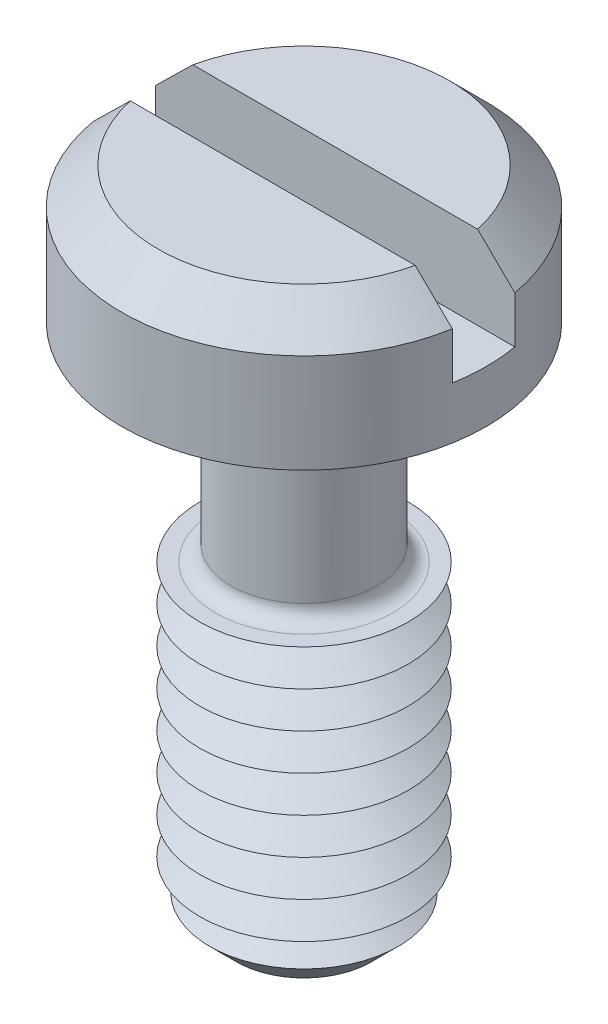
from build123d import *

# Parameters (mm, degrees)
SKETCH1_R           = 3.5
BOSS_EXTRUDE1_DEPTH = 2.6
SKETCH2_R           = 1.4
BOSS_EXTRUDE2_DEPTH = 10
SKETCH3_R           = 2
BOSS_EXTRUDE3_DEPTH = 6
CHAMFER1_SIZE       = 0.7
LPATTERN1_COUNT     = 8
LPATTERN1_PITCH     = 0.7
FILLET1_R           = 0.3
CHAMFER2_SIZE       = 0.7
SKETCH6_W           = 7
SKETCH6_H           = 1.2
CUT_EXTRUDE1_DEPTH  = 1.6


with BuildPart() as part:
    # Sketch1 → Boss-Extrude1 (new body)
    with BuildSketch(Plane(origin=(0, 0, 0), x_dir=(1, 0, 0), z_dir=(0, 1, 0))):
        with Locations(Location((0, 0, 0), (0, 0, 270))):
            Circle(SKETCH1_R)
    extrude(amount=BOSS_EXTRUDE1_DEPTH)

    # Sketch2 → Boss-Extrude2 (add)
    with BuildSketch(Plane.XZ):
        with Locations(Location((0, 0, 0), (0, 0, 270))):
            Circle(SKETCH2_R)
    extrude(amount=BOSS_EXTRUDE2_DEPTH)

    # Sketch3 → Boss-Extrude3 (add)
    with BuildSketch(Plane.XZ.offset(10)):
        with Locations(Location((0, 0, 0), (0, 0, 270))):
            Circle(SKETCH3_R)
    extrude(amount=-BOSS_EXTRUDE3_DEPTH)

    # Chamfer1
    chamfer1_edges = [part.edges().sort_by_distance(p)[0] for p in [
        (0, -10, 2),
    ]]
    chamfer(chamfer1_edges, length=CHAMFER1_SIZE)

    # Sketch5 → Cut-Revolve1 (revolve, cut)
    with BuildSketch(Plane(origin=(0, 0, 0), x_dir=(0, 0, -1), z_dir=(1, 0, 0))):
        Polygon((-2, -4), (-1.393782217, -4.35), (-2, -4.7), align=None)
    cut_revolve1 = revolve(axis=Axis((0, -6.58711856, 0), (0, -1, 0)), mode=Mode.SUBTRACT)

    # LPattern1: Cut-Revolve1 ×8
    with Locations(*[(0, -i * LPATTERN1_PITCH, 0) for i in range(1, LPATTERN1_COUNT)]):
        add(cut_revolve1, mode=Mode.SUBTRACT)

    # Fillet1
    fillet1_edges = [part.edges().sort_by_distance(p)[0] for p in [
        (0, 0, 1.4),
        (0, -4, 1.4),
    ]]
    fillet(fillet1_edges, radius=FILLET1_R)

    # Chamfer2
    chamfer2_edges = [part.edges().sort_by_distance(p)[0] for p in [
        (0, 2.6, -3.5),
    ]]
    chamfer(chamfer2_edges, length=CHAMFER2_SIZE)

    # Sketch6 → Cut-Extrude1 (cut)
    with BuildSketch(Plane(origin=(0, 2.6, 0), x_dir=(1, 0, 0), z_dir=(0, 1, 0))):
        Rectangle(SKETCH6_W, SKETCH6_H)
    extrude(amount=-CUT_EXTRUDE1_DEPTH, mode=Mode.SUBTRACT)


solid = part.part
